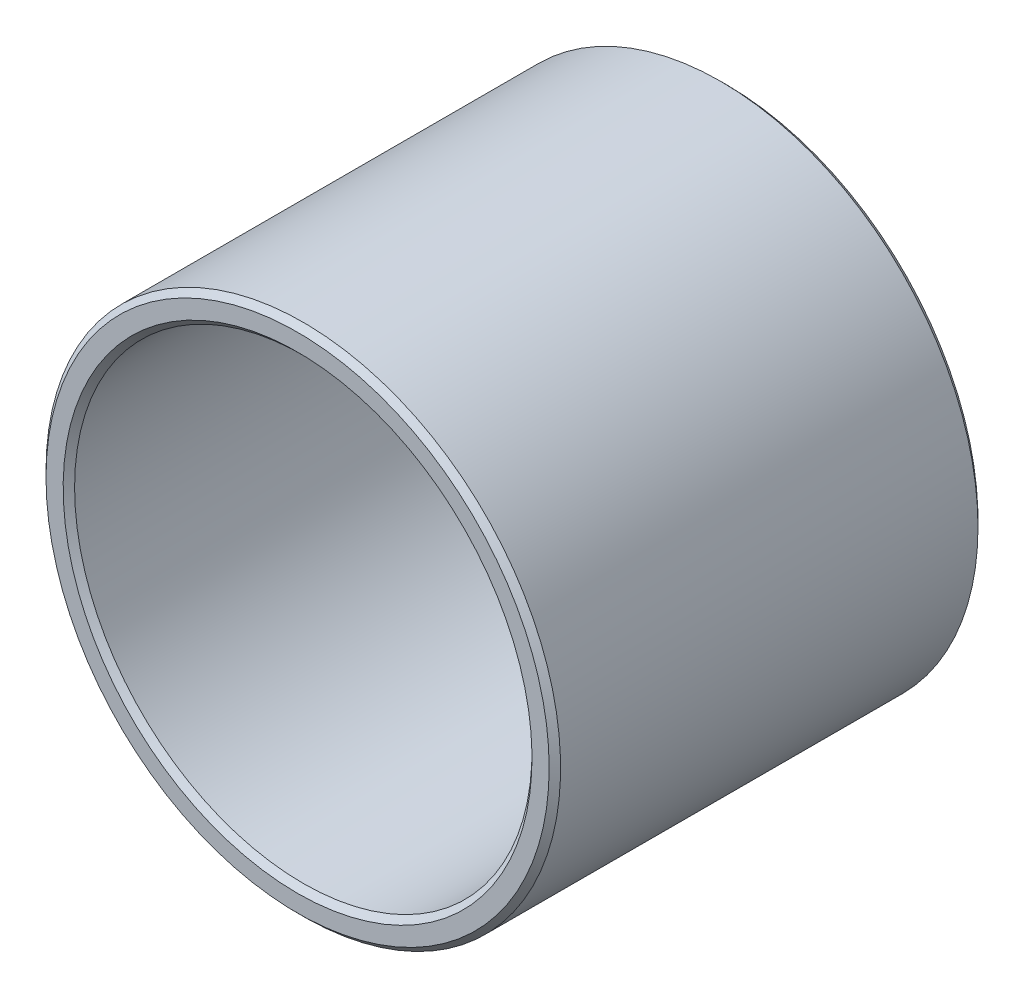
ISO-10303-21;
HEADER;
FILE_DESCRIPTION(('STEP AP214'),'2;1');
FILE_NAME('part.step','',(''),(''),'','','');
FILE_SCHEMA(('AUTOMOTIVE_DESIGN { 1 0 10303 214 1 1 1 1 }'));
ENDSEC;
DATA;
#1=APPLICATION_CONTEXT('core data for automotive mechanical design processes');
#2=APPLICATION_PROTOCOL_DEFINITION('international standard','automotive_design',2000,#1);
#3=PRODUCT_CONTEXT('',#1,'mechanical');
#4=PRODUCT('Part','Part','',(#3));
#5=PRODUCT_RELATED_PRODUCT_CATEGORY('part','',(#4));
#6=PRODUCT_DEFINITION_FORMATION('','',#4);
#7=PRODUCT_DEFINITION_CONTEXT('part definition',#1,'design');
#8=PRODUCT_DEFINITION('design','',#6,#7);
#9=PRODUCT_DEFINITION_SHAPE('','',#8);
#10=(LENGTH_UNIT() NAMED_UNIT(*) SI_UNIT(.MILLI.,.METRE.));
#11=(NAMED_UNIT(*) PLANE_ANGLE_UNIT() SI_UNIT($,.RADIAN.));
#12=(NAMED_UNIT(*) SI_UNIT($,.STERADIAN.) SOLID_ANGLE_UNIT());
#13=UNCERTAINTY_MEASURE_WITH_UNIT(LENGTH_MEASURE(1.E-05),#10,'distance_accuracy_value','');
#14=(GEOMETRIC_REPRESENTATION_CONTEXT(3) GLOBAL_UNCERTAINTY_ASSIGNED_CONTEXT((#13)) GLOBAL_UNIT_ASSIGNED_CONTEXT((#10,
#11,#12)) REPRESENTATION_CONTEXT('',''));
#15=CARTESIAN_POINT('',(0.,0.,0.));
#16=DIRECTION('',(0.,0.,1.));
#17=DIRECTION('',(1.,0.,0.));
#18=AXIS2_PLACEMENT_3D('',#15,#16,#17);
#19=CARTESIAN_POINT('',(0.,0.,0.));
#20=DIRECTION('',(0.,0.,-1.));
#21=DIRECTION('',(-1.,0.,0.));
#22=AXIS2_PLACEMENT_3D('',#19,#20,#21);
#23=CYLINDRICAL_SURFACE('',#22,8.);
#24=CARTESIAN_POINT('',(0.,0.,-14.8));
#25=DIRECTION('',(0.,0.,-1.));
#26=DIRECTION('',(-1.,0.,0.));
#27=AXIS2_PLACEMENT_3D('',#24,#25,#26);
#28=CIRCLE('',#27,8.);
#29=CARTESIAN_POINT('',(-8.,0.,-14.8));
#30=VERTEX_POINT('',#29);
#31=EDGE_CURVE('E31',#30,#30,#28,.F.);
#32=ORIENTED_EDGE('',*,*,#31,.F.);
#33=EDGE_LOOP('',(#32));
#34=FACE_BOUND('',#33,.T.);
#35=CARTESIAN_POINT('',(0.,0.,-0.200000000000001));
#36=DIRECTION('',(0.,0.,1.));
#37=DIRECTION('',(-1.,0.,0.));
#38=AXIS2_PLACEMENT_3D('',#35,#36,#37);
#39=CIRCLE('',#38,8.);
#40=CARTESIAN_POINT('',(-8.,0.,-0.200000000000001));
#41=VERTEX_POINT('',#40);
#42=EDGE_CURVE('E34',#41,#41,#39,.F.);
#43=ORIENTED_EDGE('',*,*,#42,.F.);
#44=EDGE_LOOP('',(#43));
#45=FACE_BOUND('',#44,.T.);
#46=ADVANCED_FACE('F15',(#34,#45),#23,.F.);
#47=CARTESIAN_POINT('',(0.,0.,-0.200000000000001));
#48=DIRECTION('',(0.,0.,1.));
#49=DIRECTION('',(0.,-1.,0.));
#50=AXIS2_PLACEMENT_3D('',#47,#48,#49);
#51=CONICAL_SURFACE('',#50,8.,0.785398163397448);
#52=ORIENTED_EDGE('',*,*,#42,.T.);
#53=EDGE_LOOP('',(#52));
#54=FACE_BOUND('',#53,.T.);
#55=CARTESIAN_POINT('',(0.,0.,0.));
#56=DIRECTION('',(0.,0.,1.));
#57=DIRECTION('',(0.,-1.,0.));
#58=AXIS2_PLACEMENT_3D('',#55,#56,#57);
#59=CIRCLE('',#58,8.2);
#60=CARTESIAN_POINT('',(0.,-8.2,0.));
#61=VERTEX_POINT('',#60);
#62=EDGE_CURVE('E19',#61,#61,#59,.T.);
#63=ORIENTED_EDGE('',*,*,#62,.T.);
#64=EDGE_LOOP('',(#63));
#65=FACE_BOUND('',#64,.T.);
#66=ADVANCED_FACE('F48',(#54,#65),#51,.F.);
#67=CARTESIAN_POINT('',(0.,0.,-14.8));
#68=DIRECTION('',(0.,0.,-1.));
#69=DIRECTION('',(-1.,0.,0.));
#70=AXIS2_PLACEMENT_3D('',#67,#68,#69);
#71=CONICAL_SURFACE('',#70,8.,0.785398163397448);
#72=CARTESIAN_POINT('',(0.,0.,-15.));
#73=DIRECTION('',(0.,0.,-1.));
#74=DIRECTION('',(-1.,0.,0.));
#75=AXIS2_PLACEMENT_3D('',#72,#73,#74);
#76=CIRCLE('',#75,8.2);
#77=CARTESIAN_POINT('',(-8.2,0.,-15.));
#78=VERTEX_POINT('',#77);
#79=EDGE_CURVE('E41',#78,#78,#76,.F.);
#80=ORIENTED_EDGE('',*,*,#79,.F.);
#81=EDGE_LOOP('',(#80));
#82=FACE_BOUND('',#81,.T.);
#83=ORIENTED_EDGE('',*,*,#31,.T.);
#84=EDGE_LOOP('',(#83));
#85=FACE_BOUND('',#84,.T.);
#86=ADVANCED_FACE('F53',(#82,#85),#71,.F.);
#87=CARTESIAN_POINT('',(0.,0.,0.));
#88=DIRECTION('',(0.,0.,-1.));
#89=DIRECTION('',(-1.,0.,0.));
#90=AXIS2_PLACEMENT_3D('',#87,#88,#89);
#91=PLANE('',#90);
#92=CARTESIAN_POINT('',(0.,0.,0.));
#93=DIRECTION('',(0.,0.,-1.));
#94=DIRECTION('',(-1.,0.,0.));
#95=AXIS2_PLACEMENT_3D('',#92,#93,#94);
#96=CIRCLE('',#95,8.8);
#97=CARTESIAN_POINT('',(-8.8,0.,0.));
#98=VERTEX_POINT('',#97);
#99=EDGE_CURVE('E39',#98,#98,#96,.T.);
#100=ORIENTED_EDGE('',*,*,#99,.F.);
#101=EDGE_LOOP('',(#100));
#102=FACE_BOUND('',#101,.T.);
#103=ORIENTED_EDGE('',*,*,#62,.F.);
#104=EDGE_LOOP('',(#103));
#105=FACE_BOUND('',#104,.T.);
#106=ADVANCED_FACE('F50',(#102,#105),#91,.F.);
#107=CARTESIAN_POINT('',(0.,0.,-15.));
#108=DIRECTION('',(0.,0.,-1.));
#109=DIRECTION('',(-1.,0.,0.));
#110=AXIS2_PLACEMENT_3D('',#107,#108,#109);
#111=PLANE('',#110);
#112=ORIENTED_EDGE('',*,*,#79,.T.);
#113=EDGE_LOOP('',(#112));
#114=FACE_BOUND('',#113,.T.);
#115=CARTESIAN_POINT('',(0.,0.,-15.));
#116=DIRECTION('',(0.,0.,1.));
#117=DIRECTION('',(0.,-1.,0.));
#118=AXIS2_PLACEMENT_3D('',#115,#116,#117);
#119=CIRCLE('',#118,8.8);
#120=CARTESIAN_POINT('',(0.,-8.8,-15.));
#121=VERTEX_POINT('',#120);
#122=EDGE_CURVE('E28',#121,#121,#119,.T.);
#123=ORIENTED_EDGE('',*,*,#122,.F.);
#124=EDGE_LOOP('',(#123));
#125=FACE_BOUND('',#124,.T.);
#126=ADVANCED_FACE('F52',(#114,#125),#111,.T.);
#127=CARTESIAN_POINT('',(0.,0.,-0.200000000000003));
#128=DIRECTION('',(0.,0.,-1.));
#129=DIRECTION('',(-1.,0.,0.));
#130=AXIS2_PLACEMENT_3D('',#127,#128,#129);
#131=CONICAL_SURFACE('',#130,9.,0.785398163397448);
#132=ORIENTED_EDGE('',*,*,#99,.T.);
#133=EDGE_LOOP('',(#132));
#134=FACE_BOUND('',#133,.T.);
#135=CARTESIAN_POINT('',(0.,0.,-0.2));
#136=DIRECTION('',(0.,0.,-1.));
#137=DIRECTION('',(-1.,0.,0.));
#138=AXIS2_PLACEMENT_3D('',#135,#136,#137);
#139=CIRCLE('',#138,9.);
#140=CARTESIAN_POINT('',(-9.,0.,-0.2));
#141=VERTEX_POINT('',#140);
#142=EDGE_CURVE('E23',#141,#141,#139,.T.);
#143=ORIENTED_EDGE('',*,*,#142,.F.);
#144=EDGE_LOOP('',(#143));
#145=FACE_BOUND('',#144,.T.);
#146=ADVANCED_FACE('F61',(#134,#145),#131,.T.);
#147=CARTESIAN_POINT('',(0.,0.,-14.8));
#148=DIRECTION('',(0.,0.,1.));
#149=DIRECTION('',(0.,-1.,0.));
#150=AXIS2_PLACEMENT_3D('',#147,#148,#149);
#151=CONICAL_SURFACE('',#150,9.,0.785398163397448);
#152=ORIENTED_EDGE('',*,*,#122,.T.);
#153=EDGE_LOOP('',(#152));
#154=FACE_BOUND('',#153,.T.);
#155=CARTESIAN_POINT('',(0.,0.,-14.8));
#156=DIRECTION('',(0.,0.,-1.));
#157=DIRECTION('',(-1.,0.,0.));
#158=AXIS2_PLACEMENT_3D('',#155,#156,#157);
#159=CIRCLE('',#158,9.);
#160=CARTESIAN_POINT('',(-9.,0.,-14.8));
#161=VERTEX_POINT('',#160);
#162=EDGE_CURVE('E10',#161,#161,#159,.F.);
#163=ORIENTED_EDGE('',*,*,#162,.F.);
#164=EDGE_LOOP('',(#163));
#165=FACE_BOUND('',#164,.T.);
#166=ADVANCED_FACE('F67',(#154,#165),#151,.T.);
#167=CARTESIAN_POINT('',(0.,0.,0.));
#168=DIRECTION('',(0.,0.,-1.));
#169=DIRECTION('',(-1.,0.,0.));
#170=AXIS2_PLACEMENT_3D('',#167,#168,#169);
#171=CYLINDRICAL_SURFACE('',#170,9.);
#172=ORIENTED_EDGE('',*,*,#142,.T.);
#173=EDGE_LOOP('',(#172));
#174=FACE_BOUND('',#173,.T.);
#175=ORIENTED_EDGE('',*,*,#162,.T.);
#176=EDGE_LOOP('',(#175));
#177=FACE_BOUND('',#176,.T.);
#178=ADVANCED_FACE('F17',(#174,#177),#171,.T.);
#179=CLOSED_SHELL('',(#46,#66,#86,#106,#126,#146,#166,#178));
#180=MANIFOLD_SOLID_BREP('B1',#179);
#181=ADVANCED_BREP_SHAPE_REPRESENTATION('',(#18,#180),#14);
#182=SHAPE_DEFINITION_REPRESENTATION(#9,#181);
ENDSEC;
END-ISO-10303-21;
